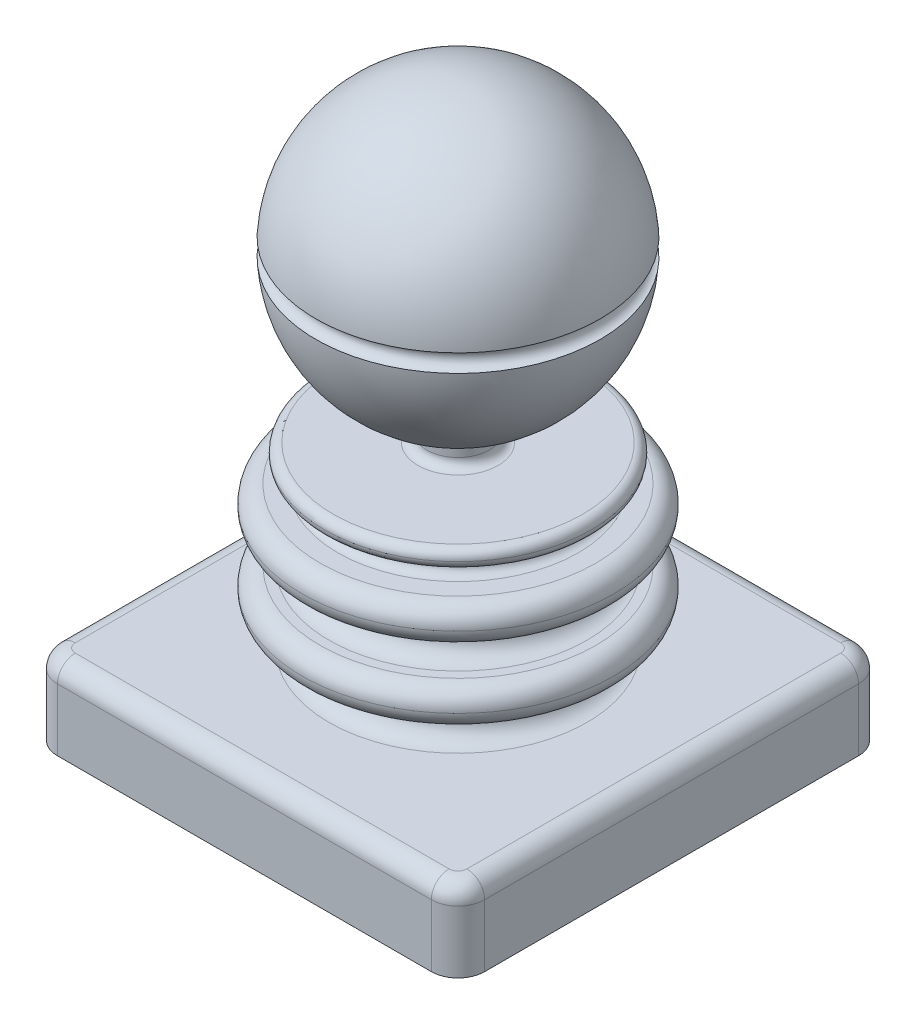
ISO-10303-21;
HEADER;
FILE_DESCRIPTION(('STEP AP214'),'2;1');
FILE_NAME('part.step','',(''),(''),'','','');
FILE_SCHEMA(('AUTOMOTIVE_DESIGN { 1 0 10303 214 1 1 1 1 }'));
ENDSEC;
DATA;
#1=APPLICATION_CONTEXT('core data for automotive mechanical design processes');
#2=APPLICATION_PROTOCOL_DEFINITION('international standard','automotive_design',2000,#1);
#3=PRODUCT_CONTEXT('',#1,'mechanical');
#4=PRODUCT('Part','Part','',(#3));
#5=PRODUCT_RELATED_PRODUCT_CATEGORY('part','',(#4));
#6=PRODUCT_DEFINITION_FORMATION('','',#4);
#7=PRODUCT_DEFINITION_CONTEXT('part definition',#1,'design');
#8=PRODUCT_DEFINITION('design','',#6,#7);
#9=PRODUCT_DEFINITION_SHAPE('','',#8);
#10=(LENGTH_UNIT() NAMED_UNIT(*) SI_UNIT(.MILLI.,.METRE.));
#11=(NAMED_UNIT(*) PLANE_ANGLE_UNIT() SI_UNIT($,.RADIAN.));
#12=(NAMED_UNIT(*) SI_UNIT($,.STERADIAN.) SOLID_ANGLE_UNIT());
#13=UNCERTAINTY_MEASURE_WITH_UNIT(LENGTH_MEASURE(1.E-05),#10,'distance_accuracy_value','');
#14=(GEOMETRIC_REPRESENTATION_CONTEXT(3) GLOBAL_UNCERTAINTY_ASSIGNED_CONTEXT((#13)) GLOBAL_UNIT_ASSIGNED_CONTEXT((#10,
#11,#12)) REPRESENTATION_CONTEXT('',''));
#15=CARTESIAN_POINT('',(0.,0.,0.));
#16=DIRECTION('',(0.,0.,1.));
#17=DIRECTION('',(1.,0.,0.));
#18=AXIS2_PLACEMENT_3D('',#15,#16,#17);
#19=CARTESIAN_POINT('',(21.,9.,-21.));
#20=DIRECTION('',(0.,1.,0.));
#21=DIRECTION('',(0.,0.,1.));
#22=AXIS2_PLACEMENT_3D('',#19,#20,#21);
#23=PLANE('',#22);
#24=CARTESIAN_POINT('',(0.,9.,0.));
#25=DIRECTION('',(0.,1.,0.));
#26=DIRECTION('',(0.,0.,1.));
#27=AXIS2_PLACEMENT_3D('',#24,#25,#26);
#28=CIRCLE('',#27,14.5);
#29=CARTESIAN_POINT('',(0.,9.,14.5));
#30=VERTEX_POINT('',#29);
#31=EDGE_CURVE('E216',#30,#30,#28,.F.);
#32=ORIENTED_EDGE('',*,*,#31,.T.);
#33=EDGE_LOOP('',(#32));
#34=FACE_BOUND('',#33,.T.);
#35=CARTESIAN_POINT('',(21.,9.,-21.));
#36=DIRECTION('',(0.,1.,0.));
#37=DIRECTION('',(0.,0.,1.));
#38=AXIS2_PLACEMENT_3D('',#35,#36,#37);
#39=CIRCLE('',#38,0.999999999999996);
#40=CARTESIAN_POINT('',(22.,9.,-21.));
#41=VERTEX_POINT('',#40);
#42=CARTESIAN_POINT('',(21.,9.,-22.));
#43=VERTEX_POINT('',#42);
#44=EDGE_CURVE('E209',#41,#43,#39,.T.);
#45=ORIENTED_EDGE('',*,*,#44,.T.);
#46=DIRECTION('',(-1.,0.,0.));
#47=VECTOR('',#46,1.);
#48=CARTESIAN_POINT('',(-21.,9.,-22.));
#49=LINE('',#48,#47);
#50=CARTESIAN_POINT('',(-21.,9.,-22.));
#51=VERTEX_POINT('',#50);
#52=EDGE_CURVE('E213',#43,#51,#49,.T.);
#53=ORIENTED_EDGE('',*,*,#52,.T.);
#54=CARTESIAN_POINT('',(-21.,9.,-21.));
#55=DIRECTION('',(0.,1.,0.));
#56=DIRECTION('',(0.,0.,1.));
#57=AXIS2_PLACEMENT_3D('',#54,#55,#56);
#58=CIRCLE('',#57,0.999999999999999);
#59=CARTESIAN_POINT('',(-22.,9.,-21.));
#60=VERTEX_POINT('',#59);
#61=EDGE_CURVE('E211',#51,#60,#58,.T.);
#62=ORIENTED_EDGE('',*,*,#61,.T.);
#63=DIRECTION('',(0.,0.,1.));
#64=VECTOR('',#63,1.);
#65=CARTESIAN_POINT('',(-22.,9.,21.));
#66=LINE('',#65,#64);
#67=CARTESIAN_POINT('',(-22.,9.,21.));
#68=VERTEX_POINT('',#67);
#69=EDGE_CURVE('E207',#60,#68,#66,.T.);
#70=ORIENTED_EDGE('',*,*,#69,.T.);
#71=CARTESIAN_POINT('',(-21.,9.,21.));
#72=DIRECTION('',(0.,1.,0.));
#73=DIRECTION('',(0.,0.,1.));
#74=AXIS2_PLACEMENT_3D('',#71,#72,#73);
#75=CIRCLE('',#74,0.999999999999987);
#76=CARTESIAN_POINT('',(-21.,9.,22.));
#77=VERTEX_POINT('',#76);
#78=EDGE_CURVE('E203',#68,#77,#75,.T.);
#79=ORIENTED_EDGE('',*,*,#78,.T.);
#80=DIRECTION('',(1.,0.,0.));
#81=VECTOR('',#80,1.);
#82=CARTESIAN_POINT('',(21.,9.,22.));
#83=LINE('',#82,#81);
#84=CARTESIAN_POINT('',(21.,9.,22.));
#85=VERTEX_POINT('',#84);
#86=EDGE_CURVE('E199',#77,#85,#83,.T.);
#87=ORIENTED_EDGE('',*,*,#86,.T.);
#88=CARTESIAN_POINT('',(21.,9.,21.));
#89=DIRECTION('',(0.,1.,0.));
#90=DIRECTION('',(0.,0.,1.));
#91=AXIS2_PLACEMENT_3D('',#88,#89,#90);
#92=CIRCLE('',#91,0.999999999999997);
#93=CARTESIAN_POINT('',(22.,9.,21.));
#94=VERTEX_POINT('',#93);
#95=EDGE_CURVE('E201',#85,#94,#92,.T.);
#96=ORIENTED_EDGE('',*,*,#95,.T.);
#97=DIRECTION('',(0.,0.,-1.));
#98=VECTOR('',#97,1.);
#99=CARTESIAN_POINT('',(22.,9.,-21.));
#100=LINE('',#99,#98);
#101=EDGE_CURVE('E205',#94,#41,#100,.T.);
#102=ORIENTED_EDGE('',*,*,#101,.T.);
#103=EDGE_LOOP('',(#45,#53,#62,#70,#79,#87,#96,#102));
#104=FACE_BOUND('',#103,.T.);
#105=ADVANCED_FACE('F28',(#34,#104),#23,.T.);
#106=CARTESIAN_POINT('',(21.,9.,-21.));
#107=DIRECTION('',(0.,-1.,0.));
#108=DIRECTION('',(0.,0.,-1.));
#109=AXIS2_PLACEMENT_3D('',#106,#107,#108);
#110=CYLINDRICAL_SURFACE('',#109,3.);
#111=DIRECTION('',(0.,-1.,0.));
#112=VECTOR('',#111,1.);
#113=CARTESIAN_POINT('',(21.,9.,-24.));
#114=LINE('',#113,#112);
#115=CARTESIAN_POINT('',(21.,7.,-24.));
#116=VERTEX_POINT('',#115);
#117=CARTESIAN_POINT('',(21.,0.,-24.));
#118=VERTEX_POINT('',#117);
#119=EDGE_CURVE('E117',#116,#118,#114,.T.);
#120=ORIENTED_EDGE('',*,*,#119,.F.);
#121=CARTESIAN_POINT('',(21.,7.,-21.));
#122=DIRECTION('',(0.,1.,0.));
#123=DIRECTION('',(0.,0.,1.));
#124=AXIS2_PLACEMENT_3D('',#121,#122,#123);
#125=CIRCLE('',#124,3.);
#126=CARTESIAN_POINT('',(24.,7.,-21.));
#127=VERTEX_POINT('',#126);
#128=EDGE_CURVE('E222',#116,#127,#125,.F.);
#129=ORIENTED_EDGE('',*,*,#128,.T.);
#130=DIRECTION('',(0.,-1.,0.));
#131=VECTOR('',#130,1.);
#132=CARTESIAN_POINT('',(24.,9.,-21.));
#133=LINE('',#132,#131);
#134=CARTESIAN_POINT('',(24.,0.,-21.));
#135=VERTEX_POINT('',#134);
#136=EDGE_CURVE('E140',#127,#135,#133,.T.);
#137=ORIENTED_EDGE('',*,*,#136,.T.);
#138=CARTESIAN_POINT('',(21.,0.,-21.));
#139=DIRECTION('',(0.,1.,0.));
#140=DIRECTION('',(0.,0.,1.));
#141=AXIS2_PLACEMENT_3D('',#138,#139,#140);
#142=CIRCLE('',#141,3.);
#143=EDGE_CURVE('E134',#135,#118,#142,.T.);
#144=ORIENTED_EDGE('',*,*,#143,.T.);
#145=EDGE_LOOP('',(#120,#129,#137,#144));
#146=FACE_BOUND('',#145,.T.);
#147=ADVANCED_FACE('F30',(#146),#110,.T.);
#148=CARTESIAN_POINT('',(-21.,9.,-24.));
#149=DIRECTION('',(0.,0.,1.));
#150=DIRECTION('',(1.,0.,0.));
#151=AXIS2_PLACEMENT_3D('',#148,#149,#150);
#152=PLANE('',#151);
#153=DIRECTION('',(0.,-1.,0.));
#154=VECTOR('',#153,1.);
#155=CARTESIAN_POINT('',(-21.,9.,-24.));
#156=LINE('',#155,#154);
#157=CARTESIAN_POINT('',(-21.,7.,-24.));
#158=VERTEX_POINT('',#157);
#159=CARTESIAN_POINT('',(-21.,0.,-24.));
#160=VERTEX_POINT('',#159);
#161=EDGE_CURVE('E128',#158,#160,#156,.T.);
#162=ORIENTED_EDGE('',*,*,#161,.F.);
#163=DIRECTION('',(-1.,0.,0.));
#164=VECTOR('',#163,1.);
#165=CARTESIAN_POINT('',(21.,7.,-24.));
#166=LINE('',#165,#164);
#167=EDGE_CURVE('E124',#158,#116,#166,.F.);
#168=ORIENTED_EDGE('',*,*,#167,.T.);
#169=ORIENTED_EDGE('',*,*,#119,.T.);
#170=DIRECTION('',(-1.,0.,0.));
#171=VECTOR('',#170,1.);
#172=CARTESIAN_POINT('',(-21.,0.,-24.));
#173=LINE('',#172,#171);
#174=EDGE_CURVE('E121',#118,#160,#173,.T.);
#175=ORIENTED_EDGE('',*,*,#174,.T.);
#176=EDGE_LOOP('',(#162,#168,#169,#175));
#177=FACE_BOUND('',#176,.T.);
#178=ADVANCED_FACE('F120',(#177),#152,.F.);
#179=CARTESIAN_POINT('',(-21.,9.,-21.));
#180=DIRECTION('',(0.,-1.,0.));
#181=DIRECTION('',(0.,0.,-1.));
#182=AXIS2_PLACEMENT_3D('',#179,#180,#181);
#183=CYLINDRICAL_SURFACE('',#182,3.);
#184=DIRECTION('',(0.,-1.,0.));
#185=VECTOR('',#184,1.);
#186=CARTESIAN_POINT('',(-24.,9.,-21.));
#187=LINE('',#186,#185);
#188=CARTESIAN_POINT('',(-24.,7.,-21.));
#189=VERTEX_POINT('',#188);
#190=CARTESIAN_POINT('',(-24.,0.,-21.));
#191=VERTEX_POINT('',#190);
#192=EDGE_CURVE('E173',#189,#191,#187,.T.);
#193=ORIENTED_EDGE('',*,*,#192,.F.);
#194=CARTESIAN_POINT('',(-21.,7.,-21.));
#195=DIRECTION('',(0.,1.,0.));
#196=DIRECTION('',(0.,0.,1.));
#197=AXIS2_PLACEMENT_3D('',#194,#195,#196);
#198=CIRCLE('',#197,3.);
#199=EDGE_CURVE('E220',#189,#158,#198,.F.);
#200=ORIENTED_EDGE('',*,*,#199,.T.);
#201=ORIENTED_EDGE('',*,*,#161,.T.);
#202=CARTESIAN_POINT('',(-21.,0.,-21.));
#203=DIRECTION('',(0.,1.,0.));
#204=DIRECTION('',(0.,0.,-1.));
#205=AXIS2_PLACEMENT_3D('',#202,#203,#204);
#206=CIRCLE('',#205,3.);
#207=EDGE_CURVE('E137',#160,#191,#206,.T.);
#208=ORIENTED_EDGE('',*,*,#207,.T.);
#209=EDGE_LOOP('',(#193,#200,#201,#208));
#210=FACE_BOUND('',#209,.T.);
#211=ADVANCED_FACE('F351',(#210),#183,.T.);
#212=CARTESIAN_POINT('',(-24.,9.,-21.));
#213=DIRECTION('',(1.,0.,0.));
#214=DIRECTION('',(0.,0.,-1.));
#215=AXIS2_PLACEMENT_3D('',#212,#213,#214);
#216=PLANE('',#215);
#217=DIRECTION('',(0.,-1.,0.));
#218=VECTOR('',#217,1.);
#219=CARTESIAN_POINT('',(-24.,9.,21.));
#220=LINE('',#219,#218);
#221=CARTESIAN_POINT('',(-24.,7.,21.));
#222=VERTEX_POINT('',#221);
#223=CARTESIAN_POINT('',(-24.,0.,21.));
#224=VERTEX_POINT('',#223);
#225=EDGE_CURVE('E171',#222,#224,#220,.T.);
#226=ORIENTED_EDGE('',*,*,#225,.F.);
#227=DIRECTION('',(0.,0.,1.));
#228=VECTOR('',#227,1.);
#229=CARTESIAN_POINT('',(-24.,7.,-21.));
#230=LINE('',#229,#228);
#231=EDGE_CURVE('E224',#222,#189,#230,.F.);
#232=ORIENTED_EDGE('',*,*,#231,.T.);
#233=ORIENTED_EDGE('',*,*,#192,.T.);
#234=DIRECTION('',(0.,0.,1.));
#235=VECTOR('',#234,1.);
#236=CARTESIAN_POINT('',(-24.,0.,-21.));
#237=LINE('',#236,#235);
#238=EDGE_CURVE('E150',#191,#224,#237,.T.);
#239=ORIENTED_EDGE('',*,*,#238,.T.);
#240=EDGE_LOOP('',(#226,#232,#233,#239));
#241=FACE_BOUND('',#240,.T.);
#242=ADVANCED_FACE('F347',(#241),#216,.F.);
#243=CARTESIAN_POINT('',(-21.,9.,21.));
#244=DIRECTION('',(0.,-1.,0.));
#245=DIRECTION('',(0.,0.,-1.));
#246=AXIS2_PLACEMENT_3D('',#243,#244,#245);
#247=CYLINDRICAL_SURFACE('',#246,2.99999999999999);
#248=DIRECTION('',(0.,-1.,0.));
#249=VECTOR('',#248,1.);
#250=CARTESIAN_POINT('',(-21.,9.,24.));
#251=LINE('',#250,#249);
#252=CARTESIAN_POINT('',(-21.,7.,24.));
#253=VERTEX_POINT('',#252);
#254=CARTESIAN_POINT('',(-21.,0.,24.));
#255=VERTEX_POINT('',#254);
#256=EDGE_CURVE('E169',#253,#255,#251,.T.);
#257=ORIENTED_EDGE('',*,*,#256,.F.);
#258=CARTESIAN_POINT('',(-21.,7.,21.));
#259=DIRECTION('',(0.,1.,0.));
#260=DIRECTION('',(0.,0.,1.));
#261=AXIS2_PLACEMENT_3D('',#258,#259,#260);
#262=CIRCLE('',#261,2.99999999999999);
#263=EDGE_CURVE('E228',#253,#222,#262,.F.);
#264=ORIENTED_EDGE('',*,*,#263,.T.);
#265=ORIENTED_EDGE('',*,*,#225,.T.);
#266=CARTESIAN_POINT('',(-21.,0.,21.));
#267=DIRECTION('',(0.,1.,0.));
#268=DIRECTION('',(0.,0.,1.));
#269=AXIS2_PLACEMENT_3D('',#266,#267,#268);
#270=CIRCLE('',#269,2.99999999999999);
#271=EDGE_CURVE('E153',#224,#255,#270,.T.);
#272=ORIENTED_EDGE('',*,*,#271,.T.);
#273=EDGE_LOOP('',(#257,#264,#265,#272));
#274=FACE_BOUND('',#273,.T.);
#275=ADVANCED_FACE('F344',(#274),#247,.T.);
#276=CARTESIAN_POINT('',(-21.,9.,24.));
#277=DIRECTION('',(0.,0.,-1.));
#278=DIRECTION('',(-1.,0.,0.));
#279=AXIS2_PLACEMENT_3D('',#276,#277,#278);
#280=PLANE('',#279);
#281=DIRECTION('',(0.,-1.,0.));
#282=VECTOR('',#281,1.);
#283=CARTESIAN_POINT('',(21.,9.,24.));
#284=LINE('',#283,#282);
#285=CARTESIAN_POINT('',(21.,7.,24.));
#286=VERTEX_POINT('',#285);
#287=CARTESIAN_POINT('',(21.,0.,24.));
#288=VERTEX_POINT('',#287);
#289=EDGE_CURVE('E167',#286,#288,#284,.T.);
#290=ORIENTED_EDGE('',*,*,#289,.F.);
#291=DIRECTION('',(1.,0.,0.));
#292=VECTOR('',#291,1.);
#293=CARTESIAN_POINT('',(-21.,7.,24.));
#294=LINE('',#293,#292);
#295=EDGE_CURVE('E11',#286,#253,#294,.F.);
#296=ORIENTED_EDGE('',*,*,#295,.T.);
#297=ORIENTED_EDGE('',*,*,#256,.T.);
#298=DIRECTION('',(1.,0.,0.));
#299=VECTOR('',#298,1.);
#300=CARTESIAN_POINT('',(-21.,0.,24.));
#301=LINE('',#300,#299);
#302=EDGE_CURVE('E156',#255,#288,#301,.T.);
#303=ORIENTED_EDGE('',*,*,#302,.T.);
#304=EDGE_LOOP('',(#290,#296,#297,#303));
#305=FACE_BOUND('',#304,.T.);
#306=ADVANCED_FACE('F341',(#305),#280,.F.);
#307=CARTESIAN_POINT('',(21.,9.,21.));
#308=DIRECTION('',(0.,-1.,0.));
#309=DIRECTION('',(0.,0.,-1.));
#310=AXIS2_PLACEMENT_3D('',#307,#308,#309);
#311=CYLINDRICAL_SURFACE('',#310,3.);
#312=DIRECTION('',(0.,-1.,0.));
#313=VECTOR('',#312,1.);
#314=CARTESIAN_POINT('',(24.,9.,21.));
#315=LINE('',#314,#313);
#316=CARTESIAN_POINT('',(24.,7.,21.));
#317=VERTEX_POINT('',#316);
#318=CARTESIAN_POINT('',(24.,0.,21.));
#319=VERTEX_POINT('',#318);
#320=EDGE_CURVE('E165',#317,#319,#315,.T.);
#321=ORIENTED_EDGE('',*,*,#320,.F.);
#322=CARTESIAN_POINT('',(21.,7.,21.));
#323=DIRECTION('',(0.,1.,0.));
#324=DIRECTION('',(0.,0.,1.));
#325=AXIS2_PLACEMENT_3D('',#322,#323,#324);
#326=CIRCLE('',#325,3.);
#327=EDGE_CURVE('E43',#317,#286,#326,.F.);
#328=ORIENTED_EDGE('',*,*,#327,.T.);
#329=ORIENTED_EDGE('',*,*,#289,.T.);
#330=CARTESIAN_POINT('',(21.,0.,21.));
#331=DIRECTION('',(0.,1.,0.));
#332=DIRECTION('',(0.,0.,-1.));
#333=AXIS2_PLACEMENT_3D('',#330,#331,#332);
#334=CIRCLE('',#333,3.);
#335=EDGE_CURVE('E159',#288,#319,#334,.T.);
#336=ORIENTED_EDGE('',*,*,#335,.T.);
#337=EDGE_LOOP('',(#321,#328,#329,#336));
#338=FACE_BOUND('',#337,.T.);
#339=ADVANCED_FACE('F337',(#338),#311,.T.);
#340=CARTESIAN_POINT('',(24.,9.,-21.));
#341=DIRECTION('',(-1.,0.,0.));
#342=DIRECTION('',(0.,0.,1.));
#343=AXIS2_PLACEMENT_3D('',#340,#341,#342);
#344=PLANE('',#343);
#345=ORIENTED_EDGE('',*,*,#136,.F.);
#346=DIRECTION('',(0.,0.,-1.));
#347=VECTOR('',#346,1.);
#348=CARTESIAN_POINT('',(24.,7.,21.));
#349=LINE('',#348,#347);
#350=EDGE_CURVE('E226',#127,#317,#349,.F.);
#351=ORIENTED_EDGE('',*,*,#350,.T.);
#352=ORIENTED_EDGE('',*,*,#320,.T.);
#353=DIRECTION('',(0.,0.,-1.));
#354=VECTOR('',#353,1.);
#355=CARTESIAN_POINT('',(24.,0.,-21.));
#356=LINE('',#355,#354);
#357=EDGE_CURVE('E162',#319,#135,#356,.T.);
#358=ORIENTED_EDGE('',*,*,#357,.T.);
#359=EDGE_LOOP('',(#345,#351,#352,#358));
#360=FACE_BOUND('',#359,.T.);
#361=ADVANCED_FACE('F334',(#360),#344,.F.);
#362=CARTESIAN_POINT('',(21.,0.,-21.));
#363=DIRECTION('',(0.,1.,0.));
#364=DIRECTION('',(0.,0.,1.));
#365=AXIS2_PLACEMENT_3D('',#362,#363,#364);
#366=PLANE('',#365);
#367=ORIENTED_EDGE('',*,*,#143,.F.);
#368=ORIENTED_EDGE('',*,*,#357,.F.);
#369=ORIENTED_EDGE('',*,*,#335,.F.);
#370=ORIENTED_EDGE('',*,*,#302,.F.);
#371=ORIENTED_EDGE('',*,*,#271,.F.);
#372=ORIENTED_EDGE('',*,*,#238,.F.);
#373=ORIENTED_EDGE('',*,*,#207,.F.);
#374=ORIENTED_EDGE('',*,*,#174,.F.);
#375=EDGE_LOOP('',(#367,#368,#369,#370,#371,#372,#373,#374));
#376=FACE_BOUND('',#375,.T.);
#377=ADVANCED_FACE('F132',(#376),#366,.F.);
#378=CARTESIAN_POINT('',(12.5,13.,0.));
#379=DIRECTION('',(0.,1.,0.));
#380=DIRECTION('',(-1.,0.,0.));
#381=AXIS2_PLACEMENT_3D('',#378,#379,#380);
#382=PLANE('',#381);
#383=CARTESIAN_POINT('',(0.,13.,0.));
#384=DIRECTION('',(0.,1.,0.));
#385=DIRECTION('',(-1.,0.,0.));
#386=AXIS2_PLACEMENT_3D('',#383,#384,#385);
#387=CIRCLE('',#386,15.5);
#388=CARTESIAN_POINT('',(-15.5,13.,0.));
#389=VERTEX_POINT('',#388);
#390=EDGE_CURVE('E36',#389,#389,#387,.F.);
#391=ORIENTED_EDGE('',*,*,#390,.T.);
#392=EDGE_LOOP('',(#391));
#393=FACE_BOUND('',#392,.T.);
#394=CARTESIAN_POINT('',(0.,13.,0.));
#395=DIRECTION('',(0.,1.,0.));
#396=DIRECTION('',(-1.,0.,0.));
#397=AXIS2_PLACEMENT_3D('',#394,#395,#396);
#398=CIRCLE('',#397,14.5);
#399=CARTESIAN_POINT('',(-14.5,13.,0.));
#400=VERTEX_POINT('',#399);
#401=EDGE_CURVE('E246',#400,#400,#398,.T.);
#402=ORIENTED_EDGE('',*,*,#401,.T.);
#403=EDGE_LOOP('',(#402));
#404=FACE_BOUND('',#403,.T.);
#405=ADVANCED_FACE('F251',(#393,#404),#382,.F.);
#406=CARTESIAN_POINT('',(17.5,17.,0.));
#407=DIRECTION('',(0.,-1.,0.));
#408=DIRECTION('',(1.,0.,0.));
#409=AXIS2_PLACEMENT_3D('',#406,#407,#408);
#410=PLANE('',#409);
#411=CARTESIAN_POINT('',(0.,17.,0.));
#412=DIRECTION('',(0.,-1.,0.));
#413=DIRECTION('',(1.,0.,0.));
#414=AXIS2_PLACEMENT_3D('',#411,#412,#413);
#415=CIRCLE('',#414,14.5);
#416=CARTESIAN_POINT('',(14.5,17.,0.));
#417=VERTEX_POINT('',#416);
#418=EDGE_CURVE('E243',#417,#417,#415,.T.);
#419=ORIENTED_EDGE('',*,*,#418,.T.);
#420=EDGE_LOOP('',(#419));
#421=FACE_BOUND('',#420,.T.);
#422=CARTESIAN_POINT('',(0.,17.,0.));
#423=DIRECTION('',(0.,-1.,0.));
#424=DIRECTION('',(1.,0.,0.));
#425=AXIS2_PLACEMENT_3D('',#422,#423,#424);
#426=CIRCLE('',#425,15.5);
#427=CARTESIAN_POINT('',(15.5,17.,0.));
#428=VERTEX_POINT('',#427);
#429=EDGE_CURVE('E240',#428,#428,#426,.F.);
#430=ORIENTED_EDGE('',*,*,#429,.T.);
#431=EDGE_LOOP('',(#430));
#432=FACE_BOUND('',#431,.T.);
#433=ADVANCED_FACE('F395',(#421,#432),#410,.F.);
#434=CARTESIAN_POINT('',(12.5,21.,0.));
#435=DIRECTION('',(0.,1.,0.));
#436=DIRECTION('',(-1.,0.,0.));
#437=AXIS2_PLACEMENT_3D('',#434,#435,#436);
#438=PLANE('',#437);
#439=CARTESIAN_POINT('',(0.,21.,0.));
#440=DIRECTION('',(0.,1.,0.));
#441=DIRECTION('',(-1.,0.,0.));
#442=AXIS2_PLACEMENT_3D('',#439,#440,#441);
#443=CIRCLE('',#442,15.5);
#444=CARTESIAN_POINT('',(-15.5,21.,0.));
#445=VERTEX_POINT('',#444);
#446=EDGE_CURVE('E234',#445,#445,#443,.F.);
#447=ORIENTED_EDGE('',*,*,#446,.T.);
#448=EDGE_LOOP('',(#447));
#449=FACE_BOUND('',#448,.T.);
#450=CARTESIAN_POINT('',(0.,21.,0.));
#451=DIRECTION('',(0.,1.,0.));
#452=DIRECTION('',(-1.,0.,0.));
#453=AXIS2_PLACEMENT_3D('',#450,#451,#452);
#454=CIRCLE('',#453,14.5);
#455=CARTESIAN_POINT('',(-14.5,21.,0.));
#456=VERTEX_POINT('',#455);
#457=EDGE_CURVE('E231',#456,#456,#454,.T.);
#458=ORIENTED_EDGE('',*,*,#457,.T.);
#459=EDGE_LOOP('',(#458));
#460=FACE_BOUND('',#459,.T.);
#461=ADVANCED_FACE('F401',(#449,#460),#438,.F.);
#462=CARTESIAN_POINT('',(17.5,25.,0.));
#463=DIRECTION('',(0.,-1.,0.));
#464=DIRECTION('',(1.,0.,0.));
#465=AXIS2_PLACEMENT_3D('',#462,#463,#464);
#466=PLANE('',#465);
#467=CARTESIAN_POINT('',(0.,25.,0.));
#468=DIRECTION('',(0.,-1.,0.));
#469=DIRECTION('',(1.,0.,0.));
#470=AXIS2_PLACEMENT_3D('',#467,#468,#469);
#471=CIRCLE('',#470,15.5);
#472=CARTESIAN_POINT('',(15.5,25.,0.));
#473=VERTEX_POINT('',#472);
#474=EDGE_CURVE('E237',#473,#473,#471,.F.);
#475=ORIENTED_EDGE('',*,*,#474,.T.);
#476=EDGE_LOOP('',(#475));
#477=FACE_BOUND('',#476,.T.);
#478=CARTESIAN_POINT('',(0.,25.,0.));
#479=DIRECTION('',(0.,-1.,0.));
#480=DIRECTION('',(1.,0.,0.));
#481=AXIS2_PLACEMENT_3D('',#478,#479,#480);
#482=CIRCLE('',#481,13.5);
#483=CARTESIAN_POINT('',(13.5,25.,0.));
#484=VERTEX_POINT('',#483);
#485=EDGE_CURVE('E187',#484,#484,#482,.T.);
#486=ORIENTED_EDGE('',*,*,#485,.T.);
#487=EDGE_LOOP('',(#486));
#488=FACE_BOUND('',#487,.T.);
#489=ADVANCED_FACE('F409',(#477,#488),#466,.F.);
#490=CARTESIAN_POINT('',(12.5,27.,0.));
#491=DIRECTION('',(0.,1.,0.));
#492=DIRECTION('',(-1.,0.,0.));
#493=AXIS2_PLACEMENT_3D('',#490,#491,#492);
#494=PLANE('',#493);
#495=CARTESIAN_POINT('',(0.,27.,0.));
#496=DIRECTION('',(0.,1.,0.));
#497=DIRECTION('',(-1.,0.,0.));
#498=AXIS2_PLACEMENT_3D('',#495,#496,#497);
#499=CIRCLE('',#498,13.5);
#500=CARTESIAN_POINT('',(-13.5,27.,0.));
#501=VERTEX_POINT('',#500);
#502=EDGE_CURVE('E178',#501,#501,#499,.T.);
#503=ORIENTED_EDGE('',*,*,#502,.T.);
#504=EDGE_LOOP('',(#503));
#505=FACE_BOUND('',#504,.T.);
#506=CARTESIAN_POINT('',(0.,27.,0.));
#507=DIRECTION('',(0.,1.,0.));
#508=DIRECTION('',(-1.,0.,0.));
#509=AXIS2_PLACEMENT_3D('',#506,#507,#508);
#510=CIRCLE('',#509,14.);
#511=CARTESIAN_POINT('',(-14.,27.,0.));
#512=VERTEX_POINT('',#511);
#513=EDGE_CURVE('E127',#512,#512,#510,.F.);
#514=ORIENTED_EDGE('',*,*,#513,.T.);
#515=EDGE_LOOP('',(#514));
#516=FACE_BOUND('',#515,.T.);
#517=ADVANCED_FACE('F417',(#505,#516),#494,.F.);
#518=CARTESIAN_POINT('',(15.,29.,0.));
#519=DIRECTION('',(0.,-1.,0.));
#520=DIRECTION('',(1.,0.,0.));
#521=AXIS2_PLACEMENT_3D('',#518,#519,#520);
#522=PLANE('',#521);
#523=CARTESIAN_POINT('',(0.,29.,0.));
#524=DIRECTION('',(0.,-1.,0.));
#525=DIRECTION('',(1.,0.,0.));
#526=AXIS2_PLACEMENT_3D('',#523,#524,#525);
#527=CIRCLE('',#526,14.);
#528=CARTESIAN_POINT('',(14.,29.,0.));
#529=VERTEX_POINT('',#528);
#530=EDGE_CURVE('E184',#529,#529,#527,.F.);
#531=ORIENTED_EDGE('',*,*,#530,.T.);
#532=EDGE_LOOP('',(#531));
#533=FACE_BOUND('',#532,.T.);
#534=CARTESIAN_POINT('',(0.,29.,0.));
#535=DIRECTION('',(0.,-1.,0.));
#536=DIRECTION('',(1.,0.,0.));
#537=AXIS2_PLACEMENT_3D('',#534,#535,#536);
#538=CIRCLE('',#537,4.5);
#539=CARTESIAN_POINT('',(4.5,29.,0.));
#540=VERTEX_POINT('',#539);
#541=EDGE_CURVE('E181',#540,#540,#538,.T.);
#542=ORIENTED_EDGE('',*,*,#541,.T.);
#543=EDGE_LOOP('',(#542));
#544=FACE_BOUND('',#543,.T.);
#545=ADVANCED_FACE('F321',(#533,#544),#522,.F.);
#546=CARTESIAN_POINT('',(0.,17.1118112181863,0.));
#547=DIRECTION('',(0.,1.,0.));
#548=DIRECTION('',(-1.,0.,0.));
#549=AXIS2_PLACEMENT_3D('',#546,#547,#548);
#550=CYLINDRICAL_SURFACE('',#549,3.5);
#551=CARTESIAN_POINT('',(0.,31.606403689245,0.));
#552=DIRECTION('',(0.,1.,0.));
#553=DIRECTION('',(-1.,0.,0.));
#554=AXIS2_PLACEMENT_3D('',#551,#552,#553);
#555=CIRCLE('',#554,3.5);
#556=CARTESIAN_POINT('',(-3.5,31.606403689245,0.));
#557=VERTEX_POINT('',#556);
#558=EDGE_CURVE('E196',#557,#557,#555,.F.);
#559=ORIENTED_EDGE('',*,*,#558,.T.);
#560=EDGE_LOOP('',(#559));
#561=FACE_BOUND('',#560,.T.);
#562=CARTESIAN_POINT('',(0.,30.,0.));
#563=DIRECTION('',(0.,-1.,0.));
#564=DIRECTION('',(1.,0.,0.));
#565=AXIS2_PLACEMENT_3D('',#562,#563,#564);
#566=CIRCLE('',#565,3.5);
#567=CARTESIAN_POINT('',(3.5,30.,0.));
#568=VERTEX_POINT('',#567);
#569=EDGE_CURVE('E193',#568,#568,#566,.F.);
#570=ORIENTED_EDGE('',*,*,#569,.T.);
#571=EDGE_LOOP('',(#570));
#572=FACE_BOUND('',#571,.T.);
#573=ADVANCED_FACE('F315',(#561,#572),#550,.T.);
#574=CARTESIAN_POINT('',(0.,48.,0.));
#575=DIRECTION('',(0.,1.,0.));
#576=DIRECTION('',(1.,0.,0.));
#577=AXIS2_PLACEMENT_3D('',#574,#575,#576);
#578=SPHERICAL_SURFACE('',#577,16.);
#579=CARTESIAN_POINT('',(0.,32.5707328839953,0.));
#580=DIRECTION('',(0.,1.,0.));
#581=DIRECTION('',(-1.,0.,0.));
#582=AXIS2_PLACEMENT_3D('',#579,#580,#581);
#583=CIRCLE('',#582,4.23529411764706);
#584=CARTESIAN_POINT('',(4.23529411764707,32.5707328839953,0.));
#585=VERTEX_POINT('',#584);
#586=EDGE_CURVE('E190',#585,#585,#583,.T.);
#587=CARTESIAN_POINT('',(0.,47.0004884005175,0.));
#588=DIRECTION('',(0.,1.,0.));
#589=DIRECTION('',(-1.,0.,0.));
#590=AXIS2_PLACEMENT_3D('',#587,#588,#589);
#591=CIRCLE('',#590,15.96875);
#592=CARTESIAN_POINT('',(15.96875,47.0004884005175,0.));
#593=VERTEX_POINT('',#592);
#594=EDGE_CURVE('E142',#593,#593,#591,.T.);
#595=CARTESIAN_POINT('',(4.23529411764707,32.5707328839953,0.));
#596=CARTESIAN_POINT('',(4.43465170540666,32.625453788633,0.));
#597=CARTESIAN_POINT('',(4.63294744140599,32.6840424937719,0.));
#598=CARTESIAN_POINT('',(5.02712017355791,32.8088584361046,0.));
#599=CARTESIAN_POINT('',(5.22299716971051,32.8750856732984,0.));
#600=CARTESIAN_POINT('',(5.61203738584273,33.0150816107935,0.));
#601=CARTESIAN_POINT('',(5.80520060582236,33.0888503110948,0.));
#602=CARTESIAN_POINT('',(6.18852328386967,33.2438177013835,0.));
#603=CARTESIAN_POINT('',(6.37868274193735,33.3250163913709,0.));
#604=CARTESIAN_POINT('',(6.75571216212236,33.4947219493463,0.));
#605=CARTESIAN_POINT('',(6.94258212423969,33.5832288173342,0.));
#606=CARTESIAN_POINT('',(7.31275183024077,33.767417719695,0.));
#607=CARTESIAN_POINT('',(7.49605157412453,33.8630997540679,0.));
#608=CARTESIAN_POINT('',(7.85880546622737,34.0614952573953,0.));
#609=CARTESIAN_POINT('',(8.03825961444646,34.1642087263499,0.));
#610=CARTESIAN_POINT('',(8.39305272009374,34.3765127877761,0.));
#611=CARTESIAN_POINT('',(8.56839167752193,34.4861033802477,0.));
#612=CARTESIAN_POINT('',(8.9146909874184,34.7119970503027,0.));
#613=CARTESIAN_POINT('',(9.08565133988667,34.8283001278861,0.));
#614=CARTESIAN_POINT('',(9.42293660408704,35.0674440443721,0.));
#615=CARTESIAN_POINT('',(9.58926151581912,35.1902848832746,0.));
#616=CARTESIAN_POINT('',(9.91702602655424,35.4423197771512,0.));
#617=CARTESIAN_POINT('',(10.0784656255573,35.5715138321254,0.));
#618=CARTESIAN_POINT('',(10.396216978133,35.8360610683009,0.));
#619=CARTESIAN_POINT('',(10.5525287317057,35.9714142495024,0.));
#620=CARTESIAN_POINT('',(10.8597895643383,36.2480763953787,0.));
#621=CARTESIAN_POINT('',(11.0107386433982,36.3893853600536,0.));
#622=CARTESIAN_POINT('',(11.3070473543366,36.6777467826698,0.));
#623=CARTESIAN_POINT('',(11.4524069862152,36.8247992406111,0.));
#624=CARTESIAN_POINT('',(11.7373184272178,37.1244267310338,0.));
#625=CARTESIAN_POINT('',(11.8768702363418,37.2770017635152,0.));
#626=CARTESIAN_POINT('',(12.149956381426,37.5874451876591,0.));
#627=CARTESIAN_POINT('',(12.2834907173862,37.7453135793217,0.));
#628=CARTESIAN_POINT('',(12.5443413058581,38.0661065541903,0.));
#629=CARTESIAN_POINT('',(12.6716575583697,38.2290311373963,0.));
#630=CARTESIAN_POINT('',(12.9198807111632,38.5596917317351,0.));
#631=CARTESIAN_POINT('',(13.0407876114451,38.7274277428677,0.));
#632=CARTESIAN_POINT('',(13.276010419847,39.0674592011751,0.));
#633=CARTESIAN_POINT('',(13.390326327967,39.2397546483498,0.));
#634=CARTESIAN_POINT('',(13.6121954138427,39.5886461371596,0.));
#635=CARTESIAN_POINT('',(13.7197485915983,39.7652421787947,0.));
#636=CARTESIAN_POINT('',(13.9279306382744,40.1224695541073,0.));
#637=CARTESIAN_POINT('',(14.0285595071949,40.3031008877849,0.));
#638=CARTESIAN_POINT('',(14.2227417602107,40.6681274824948,0.));
#639=CARTESIAN_POINT('',(14.3162951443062,40.8525227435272,0.));
#640=CARTESIAN_POINT('',(14.4961858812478,41.2248001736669,0.));
#641=CARTESIAN_POINT('',(14.582523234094,41.4126823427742,0.));
#642=CARTESIAN_POINT('',(14.7478522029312,41.7916513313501,0.));
#643=CARTESIAN_POINT('',(14.8268438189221,41.9827381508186,0.));
#644=CARTESIAN_POINT('',(14.9773626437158,42.3678293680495,0.));
#645=CARTESIAN_POINT('',(15.0488898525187,42.561833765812,0.));
#646=CARTESIAN_POINT('',(15.1843724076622,42.9524686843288,0.));
#647=CARTESIAN_POINT('',(15.2483277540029,43.1490992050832,0.));
#648=CARTESIAN_POINT('',(15.3685704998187,43.5446909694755,0.));
#649=CARTESIAN_POINT('',(15.4248578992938,43.7436522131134,0.));
#650=CARTESIAN_POINT('',(15.5296802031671,44.1436065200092,0.));
#651=CARTESIAN_POINT('',(15.5782151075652,44.3445995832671,0.));
#652=CARTESIAN_POINT('',(15.6674594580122,44.7483155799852,0.));
#653=CARTESIAN_POINT('',(15.7081689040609,44.9510385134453,0.));
#654=CARTESIAN_POINT('',(15.7817013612,45.3579096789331,0.));
#655=CARTESIAN_POINT('',(15.8145243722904,45.5620579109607,0.));
#656=CARTESIAN_POINT('',(15.8722339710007,45.9714730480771,0.));
#657=CARTESIAN_POINT('',(15.8971205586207,46.1767399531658,0.));
#658=CARTESIAN_POINT('',(15.9389224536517,46.5880838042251,0.));
#659=CARTESIAN_POINT('',(15.9558377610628,46.7941607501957,0.));
#660=CARTESIAN_POINT('',(15.96875,47.0004884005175,0.));
#661=B_SPLINE_CURVE_WITH_KNOTS('',3,(#595,#596,#597,#598,#599,#600,#601,#602,#603,#604,#605,
#606,#607,#608,#609,#610,#611,#612,#613,#614,#615,#616,#617,#618,#619,#620,#621,#622,#623,#624,
#625,#626,#627,#628,#629,#630,#631,#632,#633,#634,#635,#636,#637,#638,#639,#640,#641,#642,#643,
#644,#645,#646,#647,#648,#649,#650,#651,#652,#653,#654,#655,#656,#657,#658,#659,#660),
.UNSPECIFIED.,.F.,.F.,(4,2,2,2,2,2,2,2,2,2,2,2,2,2,2,2,2,2,2,2,2,2,2,2,2,2,2,2,2,2,2,2,4),(0.,
0.620154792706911,1.24030958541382,1.86046437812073,2.48061917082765,3.10077396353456,
3.72092875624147,4.34108354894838,4.96123834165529,5.58139313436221,6.20154792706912,
6.82170271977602,7.44185751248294,8.06201230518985,8.68216709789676,9.30232189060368,
9.92247668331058,10.5426314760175,11.1627862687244,11.7829410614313,12.4030958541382,
13.0232506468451,13.6434054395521,14.263560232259,14.8837150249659,15.5038698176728,
16.1240246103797,16.7441794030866,17.3643341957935,17.9844889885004,18.6046437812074,
19.2247985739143,19.8449533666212),.UNSPECIFIED.);
#662=EDGE_CURVE('BSEAM310',#585,#593,#661,.T.);
#663=ORIENTED_EDGE('',*,*,#586,.T.);
#664=ORIENTED_EDGE('',*,*,#594,.F.);
#665=ORIENTED_EDGE('',*,*,#662,.T.);
#666=ORIENTED_EDGE('',*,*,#662,.F.);
#667=EDGE_LOOP('',(#663,#665,#664,#666));
#668=FACE_BOUND('',#667,.T.);
#669=ADVANCED_FACE('F310',(#668),#578,.T.);
#670=CARTESIAN_POINT('',(0.,48.,0.));
#671=DIRECTION('',(0.,1.,0.));
#672=DIRECTION('',(-1.,0.,0.));
#673=AXIS2_PLACEMENT_3D('',#670,#671,#672);
#674=TOROIDAL_SURFACE('',#673,16.,0.999999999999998);
#675=CARTESIAN_POINT('',(0.,48.9995115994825,0.));
#676=DIRECTION('',(0.,1.,0.));
#677=DIRECTION('',(-1.,0.,0.));
#678=AXIS2_PLACEMENT_3D('',#675,#676,#677);
#679=CIRCLE('',#678,15.96875);
#680=CARTESIAN_POINT('',(-15.96875,48.9995115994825,0.));
#681=VERTEX_POINT('',#680);
#682=EDGE_CURVE('E145',#681,#681,#679,.T.);
#683=ORIENTED_EDGE('',*,*,#682,.F.);
#684=EDGE_LOOP('',(#683));
#685=FACE_BOUND('',#684,.T.);
#686=ORIENTED_EDGE('',*,*,#594,.T.);
#687=EDGE_LOOP('',(#686));
#688=FACE_BOUND('',#687,.T.);
#689=ADVANCED_FACE('F307',(#685,#688),#674,.F.);
#690=CARTESIAN_POINT('',(0.,48.,0.));
#691=DIRECTION('',(0.,1.,0.));
#692=DIRECTION('',(1.,0.,0.));
#693=AXIS2_PLACEMENT_3D('',#690,#691,#692);
#694=SPHERICAL_SURFACE('',#693,16.);
#695=ORIENTED_EDGE('',*,*,#682,.T.);
#696=EDGE_LOOP('',(#695));
#697=FACE_BOUND('',#696,.T.);
#698=ADVANCED_FACE('F305',(#697),#694,.T.);
#699=CARTESIAN_POINT('',(0.,26.,0.));
#700=DIRECTION('',(0.,-1.,0.));
#701=DIRECTION('',(1.,0.,0.));
#702=AXIS2_PLACEMENT_3D('',#699,#700,#701);
#703=TOROIDAL_SURFACE('',#702,13.5,1.);
#704=ORIENTED_EDGE('',*,*,#485,.F.);
#705=EDGE_LOOP('',(#704));
#706=FACE_BOUND('',#705,.T.);
#707=CARTESIAN_POINT('',(0.,26.,0.));
#708=DIRECTION('',(0.,-1.,0.));
#709=DIRECTION('',(1.,0.,0.));
#710=AXIS2_PLACEMENT_3D('',#707,#708,#709);
#711=CIRCLE('',#710,12.5);
#712=CARTESIAN_POINT('',(12.5,26.,0.));
#713=VERTEX_POINT('',#712);
#714=EDGE_CURVE('E300',#713,#713,#711,.F.);
#715=ORIENTED_EDGE('',*,*,#714,.F.);
#716=EDGE_LOOP('',(#715));
#717=FACE_BOUND('',#716,.T.);
#718=ADVANCED_FACE('F450',(#706,#717),#703,.F.);
#719=CARTESIAN_POINT('',(0.,26.,0.));
#720=DIRECTION('',(0.,1.,0.));
#721=DIRECTION('',(-1.,0.,0.));
#722=AXIS2_PLACEMENT_3D('',#719,#720,#721);
#723=TOROIDAL_SURFACE('',#722,13.5,1.);
#724=ORIENTED_EDGE('',*,*,#714,.T.);
#725=EDGE_LOOP('',(#724));
#726=FACE_BOUND('',#725,.T.);
#727=ORIENTED_EDGE('',*,*,#502,.F.);
#728=EDGE_LOOP('',(#727));
#729=FACE_BOUND('',#728,.T.);
#730=ADVANCED_FACE('F457',(#726,#729),#723,.F.);
#731=CARTESIAN_POINT('',(0.,28.,0.));
#732=DIRECTION('',(0.,-1.,0.));
#733=DIRECTION('',(1.,0.,0.));
#734=AXIS2_PLACEMENT_3D('',#731,#732,#733);
#735=TOROIDAL_SURFACE('',#734,14.,1.);
#736=ORIENTED_EDGE('',*,*,#530,.F.);
#737=EDGE_LOOP('',(#736));
#738=FACE_BOUND('',#737,.T.);
#739=CARTESIAN_POINT('',(0.,28.,0.));
#740=DIRECTION('',(0.,-1.,0.));
#741=DIRECTION('',(1.,0.,0.));
#742=AXIS2_PLACEMENT_3D('',#739,#740,#741);
#743=CIRCLE('',#742,15.);
#744=CARTESIAN_POINT('',(15.,28.,0.));
#745=VERTEX_POINT('',#744);
#746=EDGE_CURVE('E297',#745,#745,#743,.T.);
#747=ORIENTED_EDGE('',*,*,#746,.F.);
#748=EDGE_LOOP('',(#747));
#749=FACE_BOUND('',#748,.T.);
#750=ADVANCED_FACE('F465',(#738,#749),#735,.T.);
#751=CARTESIAN_POINT('',(0.,28.,0.));
#752=DIRECTION('',(0.,1.,0.));
#753=DIRECTION('',(-1.,0.,0.));
#754=AXIS2_PLACEMENT_3D('',#751,#752,#753);
#755=TOROIDAL_SURFACE('',#754,14.,1.);
#756=ORIENTED_EDGE('',*,*,#513,.F.);
#757=EDGE_LOOP('',(#756));
#758=FACE_BOUND('',#757,.T.);
#759=ORIENTED_EDGE('',*,*,#746,.T.);
#760=EDGE_LOOP('',(#759));
#761=FACE_BOUND('',#760,.T.);
#762=ADVANCED_FACE('F473',(#758,#761),#755,.T.);
#763=CARTESIAN_POINT('',(0.,31.606403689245,0.));
#764=DIRECTION('',(0.,1.,0.));
#765=DIRECTION('',(-1.,0.,0.));
#766=AXIS2_PLACEMENT_3D('',#763,#764,#765);
#767=TOROIDAL_SURFACE('',#766,4.5,1.);
#768=ORIENTED_EDGE('',*,*,#558,.F.);
#769=EDGE_LOOP('',(#768));
#770=FACE_BOUND('',#769,.T.);
#771=ORIENTED_EDGE('',*,*,#586,.F.);
#772=EDGE_LOOP('',(#771));
#773=FACE_BOUND('',#772,.T.);
#774=ADVANCED_FACE('F481',(#770,#773),#767,.F.);
#775=CARTESIAN_POINT('',(0.,30.,0.));
#776=DIRECTION('',(0.,-1.,0.));
#777=DIRECTION('',(1.,0.,0.));
#778=AXIS2_PLACEMENT_3D('',#775,#776,#777);
#779=TOROIDAL_SURFACE('',#778,4.5,1.);
#780=ORIENTED_EDGE('',*,*,#541,.F.);
#781=EDGE_LOOP('',(#780));
#782=FACE_BOUND('',#781,.T.);
#783=ORIENTED_EDGE('',*,*,#569,.F.);
#784=EDGE_LOOP('',(#783));
#785=FACE_BOUND('',#784,.T.);
#786=ADVANCED_FACE('F489',(#782,#785),#779,.F.);
#787=CARTESIAN_POINT('',(21.,7.,22.));
#788=DIRECTION('',(-1.,0.,0.));
#789=DIRECTION('',(0.,0.,1.));
#790=AXIS2_PLACEMENT_3D('',#787,#788,#789);
#791=CYLINDRICAL_SURFACE('',#790,2.);
#792=CARTESIAN_POINT('',(-21.,7.,22.));
#793=DIRECTION('',(-1.,0.,0.));
#794=DIRECTION('',(0.,-1.,0.));
#795=AXIS2_PLACEMENT_3D('',#792,#793,#794);
#796=CIRCLE('',#795,2.);
#797=EDGE_CURVE('E291',#253,#77,#796,.T.);
#798=ORIENTED_EDGE('',*,*,#797,.F.);
#799=ORIENTED_EDGE('',*,*,#295,.F.);
#800=CARTESIAN_POINT('',(21.,7.,22.));
#801=DIRECTION('',(1.,0.,0.));
#802=DIRECTION('',(0.,0.,-1.));
#803=AXIS2_PLACEMENT_3D('',#800,#801,#802);
#804=CIRCLE('',#803,2.);
#805=EDGE_CURVE('E294',#85,#286,#804,.T.);
#806=ORIENTED_EDGE('',*,*,#805,.F.);
#807=ORIENTED_EDGE('',*,*,#86,.F.);
#808=EDGE_LOOP('',(#798,#799,#806,#807));
#809=FACE_BOUND('',#808,.T.);
#810=ADVANCED_FACE('F497',(#809),#791,.T.);
#811=CARTESIAN_POINT('',(21.,7.,21.));
#812=DIRECTION('',(0.,1.,0.));
#813=DIRECTION('',(0.,0.,1.));
#814=AXIS2_PLACEMENT_3D('',#811,#812,#813);
#815=DEGENERATE_TOROIDAL_SURFACE('',#814,0.999999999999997,2.,.T.);
#816=ORIENTED_EDGE('',*,*,#805,.T.);
#817=ORIENTED_EDGE('',*,*,#327,.F.);
#818=CARTESIAN_POINT('',(22.,7.,21.));
#819=DIRECTION('',(0.,0.,-1.));
#820=DIRECTION('',(-1.,0.,0.));
#821=AXIS2_PLACEMENT_3D('',#818,#819,#820);
#822=CIRCLE('',#821,2.);
#823=EDGE_CURVE('E288',#94,#317,#822,.T.);
#824=ORIENTED_EDGE('',*,*,#823,.F.);
#825=ORIENTED_EDGE('',*,*,#95,.F.);
#826=EDGE_LOOP('',(#816,#817,#824,#825));
#827=FACE_BOUND('',#826,.T.);
#828=ADVANCED_FACE('F505',(#827),#815,.T.);
#829=CARTESIAN_POINT('',(-21.,7.,21.));
#830=DIRECTION('',(0.,1.,0.));
#831=DIRECTION('',(0.,0.,1.));
#832=AXIS2_PLACEMENT_3D('',#829,#830,#831);
#833=DEGENERATE_TOROIDAL_SURFACE('',#832,0.999999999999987,2.,.T.);
#834=ORIENTED_EDGE('',*,*,#797,.T.);
#835=ORIENTED_EDGE('',*,*,#78,.F.);
#836=CARTESIAN_POINT('',(-22.,7.,21.));
#837=DIRECTION('',(0.,0.,-1.));
#838=DIRECTION('',(0.,1.,0.));
#839=AXIS2_PLACEMENT_3D('',#836,#837,#838);
#840=CIRCLE('',#839,2.);
#841=EDGE_CURVE('E285',#222,#68,#840,.T.);
#842=ORIENTED_EDGE('',*,*,#841,.F.);
#843=ORIENTED_EDGE('',*,*,#263,.F.);
#844=EDGE_LOOP('',(#834,#835,#842,#843));
#845=FACE_BOUND('',#844,.T.);
#846=ADVANCED_FACE('F513',(#845),#833,.T.);
#847=CARTESIAN_POINT('',(22.,7.,-21.));
#848=DIRECTION('',(0.,0.,1.));
#849=DIRECTION('',(1.,0.,0.));
#850=AXIS2_PLACEMENT_3D('',#847,#848,#849);
#851=CYLINDRICAL_SURFACE('',#850,2.);
#852=ORIENTED_EDGE('',*,*,#823,.T.);
#853=ORIENTED_EDGE('',*,*,#350,.F.);
#854=CARTESIAN_POINT('',(22.,7.,-21.));
#855=DIRECTION('',(0.,0.,-1.));
#856=DIRECTION('',(-1.,0.,0.));
#857=AXIS2_PLACEMENT_3D('',#854,#855,#856);
#858=CIRCLE('',#857,2.);
#859=EDGE_CURVE('E282',#41,#127,#858,.T.);
#860=ORIENTED_EDGE('',*,*,#859,.F.);
#861=ORIENTED_EDGE('',*,*,#101,.F.);
#862=EDGE_LOOP('',(#852,#853,#860,#861));
#863=FACE_BOUND('',#862,.T.);
#864=ADVANCED_FACE('F521',(#863),#851,.T.);
#865=CARTESIAN_POINT('',(-22.,7.,-21.));
#866=DIRECTION('',(0.,0.,-1.));
#867=DIRECTION('',(-1.,0.,0.));
#868=AXIS2_PLACEMENT_3D('',#865,#866,#867);
#869=CYLINDRICAL_SURFACE('',#868,2.);
#870=ORIENTED_EDGE('',*,*,#841,.T.);
#871=ORIENTED_EDGE('',*,*,#69,.F.);
#872=CARTESIAN_POINT('',(-22.,7.,-21.));
#873=DIRECTION('',(0.,0.,-1.));
#874=DIRECTION('',(0.,1.,0.));
#875=AXIS2_PLACEMENT_3D('',#872,#873,#874);
#876=CIRCLE('',#875,2.);
#877=EDGE_CURVE('E279',#189,#60,#876,.T.);
#878=ORIENTED_EDGE('',*,*,#877,.F.);
#879=ORIENTED_EDGE('',*,*,#231,.F.);
#880=EDGE_LOOP('',(#870,#871,#878,#879));
#881=FACE_BOUND('',#880,.T.);
#882=ADVANCED_FACE('F529',(#881),#869,.T.);
#883=CARTESIAN_POINT('',(21.,7.,-21.));
#884=DIRECTION('',(0.,1.,0.));
#885=DIRECTION('',(0.,0.,1.));
#886=AXIS2_PLACEMENT_3D('',#883,#884,#885);
#887=DEGENERATE_TOROIDAL_SURFACE('',#886,0.999999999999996,2.,.T.);
#888=ORIENTED_EDGE('',*,*,#859,.T.);
#889=ORIENTED_EDGE('',*,*,#128,.F.);
#890=CARTESIAN_POINT('',(21.,7.,-22.));
#891=DIRECTION('',(-1.,0.,0.));
#892=DIRECTION('',(0.,0.,1.));
#893=AXIS2_PLACEMENT_3D('',#890,#891,#892);
#894=CIRCLE('',#893,2.);
#895=EDGE_CURVE('E277',#43,#116,#894,.T.);
#896=ORIENTED_EDGE('',*,*,#895,.F.);
#897=ORIENTED_EDGE('',*,*,#44,.F.);
#898=EDGE_LOOP('',(#888,#889,#896,#897));
#899=FACE_BOUND('',#898,.T.);
#900=ADVANCED_FACE('F537',(#899),#887,.T.);
#901=CARTESIAN_POINT('',(-21.,7.,-21.));
#902=DIRECTION('',(0.,1.,0.));
#903=DIRECTION('',(0.,0.,1.));
#904=AXIS2_PLACEMENT_3D('',#901,#902,#903);
#905=DEGENERATE_TOROIDAL_SURFACE('',#904,0.999999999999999,2.,.T.);
#906=ORIENTED_EDGE('',*,*,#877,.T.);
#907=ORIENTED_EDGE('',*,*,#61,.F.);
#908=CARTESIAN_POINT('',(-21.,7.,-22.));
#909=DIRECTION('',(1.,0.,0.));
#910=DIRECTION('',(0.,0.,-1.));
#911=AXIS2_PLACEMENT_3D('',#908,#909,#910);
#912=CIRCLE('',#911,2.);
#913=EDGE_CURVE('E275',#158,#51,#912,.T.);
#914=ORIENTED_EDGE('',*,*,#913,.F.);
#915=ORIENTED_EDGE('',*,*,#199,.F.);
#916=EDGE_LOOP('',(#906,#907,#914,#915));
#917=FACE_BOUND('',#916,.T.);
#918=ADVANCED_FACE('F545',(#917),#905,.T.);
#919=CARTESIAN_POINT('',(21.,7.,-22.));
#920=DIRECTION('',(1.,0.,0.));
#921=DIRECTION('',(0.,0.,-1.));
#922=AXIS2_PLACEMENT_3D('',#919,#920,#921);
#923=CYLINDRICAL_SURFACE('',#922,2.);
#924=ORIENTED_EDGE('',*,*,#895,.T.);
#925=ORIENTED_EDGE('',*,*,#167,.F.);
#926=ORIENTED_EDGE('',*,*,#913,.T.);
#927=ORIENTED_EDGE('',*,*,#52,.F.);
#928=EDGE_LOOP('',(#924,#925,#926,#927));
#929=FACE_BOUND('',#928,.T.);
#930=ADVANCED_FACE('F553',(#929),#923,.T.);
#931=CARTESIAN_POINT('',(0.,23.,0.));
#932=DIRECTION('',(0.,-1.,0.));
#933=DIRECTION('',(1.,0.,0.));
#934=AXIS2_PLACEMENT_3D('',#931,#932,#933);
#935=TOROIDAL_SURFACE('',#934,15.5,2.);
#936=ORIENTED_EDGE('',*,*,#474,.F.);
#937=EDGE_LOOP('',(#936));
#938=FACE_BOUND('',#937,.T.);
#939=CARTESIAN_POINT('',(0.,23.,0.));
#940=DIRECTION('',(0.,-1.,0.));
#941=DIRECTION('',(1.,0.,0.));
#942=AXIS2_PLACEMENT_3D('',#939,#940,#941);
#943=CIRCLE('',#942,17.5);
#944=CARTESIAN_POINT('',(17.5,23.,0.));
#945=VERTEX_POINT('',#944);
#946=EDGE_CURVE('E268',#945,#945,#943,.T.);
#947=ORIENTED_EDGE('',*,*,#946,.F.);
#948=EDGE_LOOP('',(#947));
#949=FACE_BOUND('',#948,.T.);
#950=ADVANCED_FACE('F561',(#938,#949),#935,.T.);
#951=CARTESIAN_POINT('',(0.,23.,0.));
#952=DIRECTION('',(0.,1.,0.));
#953=DIRECTION('',(-1.,0.,0.));
#954=AXIS2_PLACEMENT_3D('',#951,#952,#953);
#955=TOROIDAL_SURFACE('',#954,15.5,2.);
#956=ORIENTED_EDGE('',*,*,#446,.F.);
#957=EDGE_LOOP('',(#956));
#958=FACE_BOUND('',#957,.T.);
#959=ORIENTED_EDGE('',*,*,#946,.T.);
#960=EDGE_LOOP('',(#959));
#961=FACE_BOUND('',#960,.T.);
#962=ADVANCED_FACE('F569',(#958,#961),#955,.T.);
#963=CARTESIAN_POINT('',(0.,19.,0.));
#964=DIRECTION('',(0.,1.,0.));
#965=DIRECTION('',(-1.,0.,0.));
#966=AXIS2_PLACEMENT_3D('',#963,#964,#965);
#967=TOROIDAL_SURFACE('',#966,14.5,2.);
#968=ORIENTED_EDGE('',*,*,#457,.F.);
#969=EDGE_LOOP('',(#968));
#970=FACE_BOUND('',#969,.T.);
#971=CARTESIAN_POINT('',(0.,19.,0.));
#972=DIRECTION('',(0.,1.,0.));
#973=DIRECTION('',(-1.,0.,0.));
#974=AXIS2_PLACEMENT_3D('',#971,#972,#973);
#975=CIRCLE('',#974,12.5);
#976=CARTESIAN_POINT('',(-12.5,19.,0.));
#977=VERTEX_POINT('',#976);
#978=EDGE_CURVE('E264',#977,#977,#975,.F.);
#979=ORIENTED_EDGE('',*,*,#978,.F.);
#980=EDGE_LOOP('',(#979));
#981=FACE_BOUND('',#980,.T.);
#982=ADVANCED_FACE('F577',(#970,#981),#967,.F.);
#983=CARTESIAN_POINT('',(0.,19.,0.));
#984=DIRECTION('',(0.,-1.,0.));
#985=DIRECTION('',(1.,0.,0.));
#986=AXIS2_PLACEMENT_3D('',#983,#984,#985);
#987=TOROIDAL_SURFACE('',#986,14.5,2.);
#988=ORIENTED_EDGE('',*,*,#418,.F.);
#989=EDGE_LOOP('',(#988));
#990=FACE_BOUND('',#989,.T.);
#991=ORIENTED_EDGE('',*,*,#978,.T.);
#992=EDGE_LOOP('',(#991));
#993=FACE_BOUND('',#992,.T.);
#994=ADVANCED_FACE('F585',(#990,#993),#987,.F.);
#995=CARTESIAN_POINT('',(0.,15.,0.));
#996=DIRECTION('',(0.,-1.,0.));
#997=DIRECTION('',(1.,0.,0.));
#998=AXIS2_PLACEMENT_3D('',#995,#996,#997);
#999=TOROIDAL_SURFACE('',#998,15.5,2.);
#1000=ORIENTED_EDGE('',*,*,#429,.F.);
#1001=EDGE_LOOP('',(#1000));
#1002=FACE_BOUND('',#1001,.T.);
#1003=CARTESIAN_POINT('',(0.,15.,0.));
#1004=DIRECTION('',(0.,-1.,0.));
#1005=DIRECTION('',(1.,0.,0.));
#1006=AXIS2_PLACEMENT_3D('',#1003,#1004,#1005);
#1007=CIRCLE('',#1006,17.5);
#1008=CARTESIAN_POINT('',(17.5,15.,0.));
#1009=VERTEX_POINT('',#1008);
#1010=EDGE_CURVE('E262',#1009,#1009,#1007,.T.);
#1011=ORIENTED_EDGE('',*,*,#1010,.F.);
#1012=EDGE_LOOP('',(#1011));
#1013=FACE_BOUND('',#1012,.T.);
#1014=ADVANCED_FACE('F258',(#1002,#1013),#999,.T.);
#1015=CARTESIAN_POINT('',(0.,15.,0.));
#1016=DIRECTION('',(0.,1.,0.));
#1017=DIRECTION('',(-1.,0.,0.));
#1018=AXIS2_PLACEMENT_3D('',#1015,#1016,#1017);
#1019=TOROIDAL_SURFACE('',#1018,15.5,2.);
#1020=ORIENTED_EDGE('',*,*,#390,.F.);
#1021=EDGE_LOOP('',(#1020));
#1022=FACE_BOUND('',#1021,.T.);
#1023=ORIENTED_EDGE('',*,*,#1010,.T.);
#1024=EDGE_LOOP('',(#1023));
#1025=FACE_BOUND('',#1024,.T.);
#1026=ADVANCED_FACE('F254',(#1022,#1025),#1019,.T.);
#1027=CARTESIAN_POINT('',(0.,11.,0.));
#1028=DIRECTION('',(0.,1.,0.));
#1029=DIRECTION('',(-1.,0.,0.));
#1030=AXIS2_PLACEMENT_3D('',#1027,#1028,#1029);
#1031=TOROIDAL_SURFACE('',#1030,14.5,2.);
#1032=ORIENTED_EDGE('',*,*,#401,.F.);
#1033=EDGE_LOOP('',(#1032));
#1034=FACE_BOUND('',#1033,.T.);
#1035=CARTESIAN_POINT('',(0.,11.,0.));
#1036=DIRECTION('',(0.,1.,0.));
#1037=DIRECTION('',(-1.,0.,0.));
#1038=AXIS2_PLACEMENT_3D('',#1035,#1036,#1037);
#1039=CIRCLE('',#1038,12.5);
#1040=CARTESIAN_POINT('',(-12.5,11.,0.));
#1041=VERTEX_POINT('',#1040);
#1042=EDGE_CURVE('E265',#1041,#1041,#1039,.F.);
#1043=ORIENTED_EDGE('',*,*,#1042,.F.);
#1044=EDGE_LOOP('',(#1043));
#1045=FACE_BOUND('',#1044,.T.);
#1046=ADVANCED_FACE('F257',(#1034,#1045),#1031,.F.);
#1047=CARTESIAN_POINT('',(0.,11.,0.));
#1048=DIRECTION('',(0.,1.,0.));
#1049=DIRECTION('',(0.,0.,1.));
#1050=AXIS2_PLACEMENT_3D('',#1047,#1048,#1049);
#1051=TOROIDAL_SURFACE('',#1050,14.5,2.);
#1052=ORIENTED_EDGE('',*,*,#31,.F.);
#1053=EDGE_LOOP('',(#1052));
#1054=FACE_BOUND('',#1053,.T.);
#1055=ORIENTED_EDGE('',*,*,#1042,.T.);
#1056=EDGE_LOOP('',(#1055));
#1057=FACE_BOUND('',#1056,.T.);
#1058=ADVANCED_FACE('F611',(#1054,#1057),#1051,.F.);
#1059=CLOSED_SHELL('',(#105,#147,#178,#211,#242,#275,#306,#339,#361,#377,#405,#433,#461,#489,
#517,#545,#573,#669,#689,#698,#718,#730,#750,#762,#774,#786,#810,#828,#846,#864,#882,#900,#918,
#930,#950,#962,#982,#994,#1014,#1026,#1046,#1058));
#1060=MANIFOLD_SOLID_BREP('B2',#1059);
#1061=ADVANCED_BREP_SHAPE_REPRESENTATION('',(#18,#1060),#14);
#1062=SHAPE_DEFINITION_REPRESENTATION(#9,#1061);
ENDSEC;
END-ISO-10303-21;
